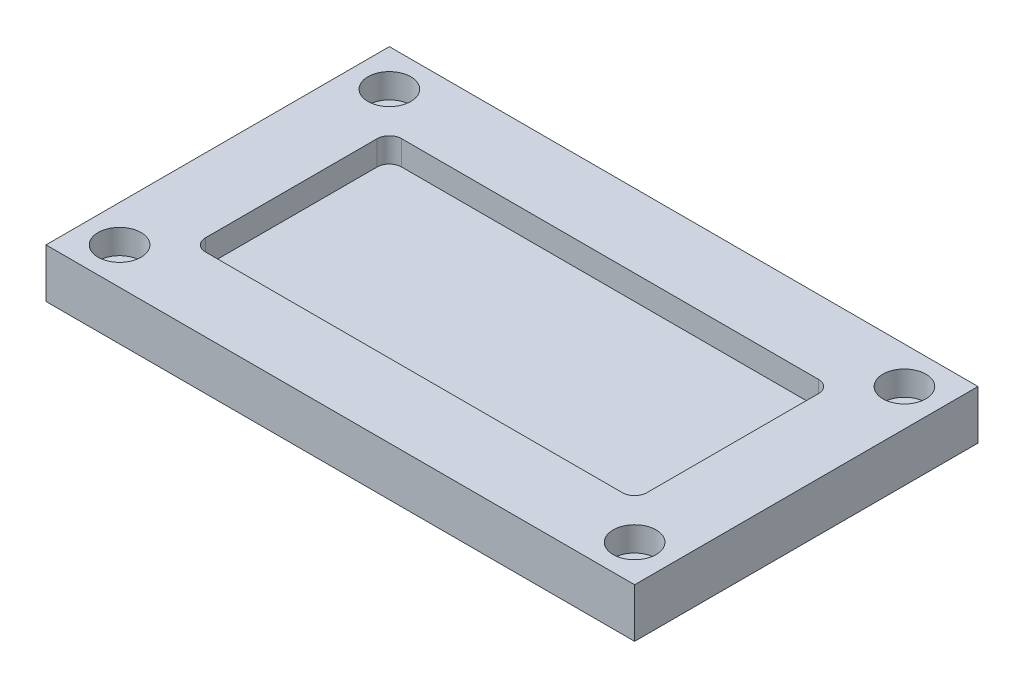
from build123d import *

# Parameters (mm, degrees)
SKETCH1_W                                        = 152.4
SKETCH1_H                                        = 88.9
BOSS_EXTRUDE1_DEPTH                              = 12.7
SKETCH1_3_W                                      = 114.3
SKETCH1_3_H                                      = 50.8
CUT_EXTRUDE1_DEPTH                               = 6.35
CBORE_FOR_1_4_SOCKET_HEAD_CAP_SCREW1_D           = 6.7564
CBORE_FOR_1_4_SOCKET_HEAD_CAP_SCREW1_CBORE_D     = 11.1125
CBORE_FOR_1_4_SOCKET_HEAD_CAP_SCREW1_CBORE_DEPTH = 6.35
FILLET1_R                                        = 3.175


with BuildPart() as part:
    # Sketch1 → Boss-Extrude1 (new body)
    with BuildSketch(Plane(origin=(0, 0, 0), x_dir=(1, 0, 0), z_dir=(0, 1, 0))):
        Rectangle(SKETCH1_W, SKETCH1_H)
    extrude(amount=-BOSS_EXTRUDE1_DEPTH)

    # Sketch1_3 → Cut-Extrude1 (cut)
    with BuildSketch(Plane(origin=(0, 0, 0), x_dir=(1, 0, 0), z_dir=(0, 1, 0))):
        Rectangle(SKETCH1_3_W, SKETCH1_3_H)
    extrude(amount=-CUT_EXTRUDE1_DEPTH, mode=Mode.SUBTRACT)

    # CBORE for 1_4 Socket Head Cap Screw1 (through all)
    with Locations(Plane(origin=(0, 0, 0), x_dir=(1, 0, 0), z_dir=(0, 1, 0))):
        with Locations((-66.675, 34.925), (-66.675, -34.925), (66.675, -34.925), (66.675, 34.925)):
            CounterBoreHole(CBORE_FOR_1_4_SOCKET_HEAD_CAP_SCREW1_D / 2, CBORE_FOR_1_4_SOCKET_HEAD_CAP_SCREW1_CBORE_D / 2, CBORE_FOR_1_4_SOCKET_HEAD_CAP_SCREW1_CBORE_DEPTH)

    # Fillet1
    fillet1_edges = [part.edges().sort_by_distance(p)[0] for p in [
        (-57.15, -3.175, 25.4),
        (-57.15, -3.175, -25.4),
        (57.15, -3.175, -25.4),
        (57.15, -3.175, 25.4),
    ]]
    fillet(fillet1_edges, radius=FILLET1_R)


solid = part.part
